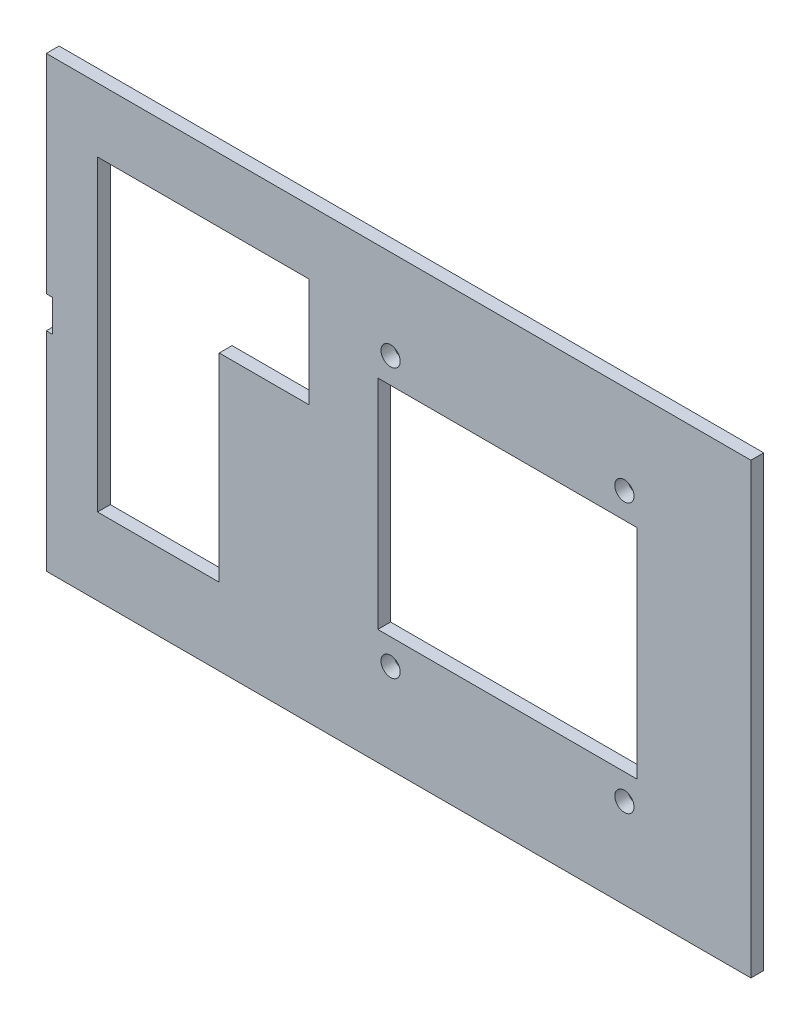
from build123d import *

# Parameters (mm, degrees)
SKETCH1_W               = 110
SKETCH1_H               = 70
BOSS_EXTRUDE1_DEPTH     = 2
CUT_EXTRUDE1_DEPTH      = 15
CUT_EXTRUDE1_DEPTH_BACK = 15
SKETCH2_W               = 2
SKETCH2_H               = 5
CUT_EXTRUDE2_DEPTH      = 10
CUT_EXTRUDE2_DEPTH_BACK = 10
SKETCH3_W               = 40.5
SKETCH3_H               = 34
CUT_EXTRUDE4_DEPTH      = 10
CUT_EXTRUDE4_DEPTH_BACK = 10
SKETCH5_R               = 1.5
CUT_EXTRUDE5_DEPTH      = 10
CUT_EXTRUDE5_DEPTH_BACK = 10
SKETCH6_W               = 19
SKETCH6_H               = 31
SKETCH6_W_2             = 33
SKETCH6_H_2             = 17


with BuildPart() as part:
    # Sketch1 → Boss-Extrude1 (new body)
    with BuildSketch(Plane.XY):
        Rectangle(SKETCH1_W, SKETCH1_H)
    extrude(amount=BOSS_EXTRUDE1_DEPTH)

    # Sketch2 → Cut-Extrude1 (cut, two sides: drawn at the far end of the back side and taken through both)
    with BuildSketch(Plane.XY.offset(2).offset(-CUT_EXTRUDE1_DEPTH_BACK)):
        with Locations((-55, 0)):
            Rectangle(SKETCH2_W, SKETCH2_H)
    extrude(amount=CUT_EXTRUDE1_DEPTH + CUT_EXTRUDE1_DEPTH_BACK, mode=Mode.SUBTRACT)

    # Sketch3 → Cut-Extrude2 (cut, two sides: drawn at the far end of the back side and taken through both)
    with BuildSketch(Plane.XY.offset(2).offset(-CUT_EXTRUDE2_DEPTH_BACK)):
        with Locations((17, 0)):
            Rectangle(SKETCH3_W, SKETCH3_H)
    extrude(amount=CUT_EXTRUDE2_DEPTH + CUT_EXTRUDE2_DEPTH_BACK, mode=Mode.SUBTRACT)

    # Sketch5 → Cut-Extrude4 (cut, two sides: drawn at the far end of the back side and taken through both)
    with BuildSketch(Plane(origin=(0, 0, 0), x_dir=(-1, 0, 0), z_dir=(0, 0, -1)).offset(-CUT_EXTRUDE4_DEPTH_BACK)):
        with Locations(Location((-35.25, 21, 0), (0, 0, 180))):
            Circle(SKETCH5_R)
        with Locations(Location((1.25, 21, 0), (0, 0, 180))):
            Circle(SKETCH5_R)
        with Locations(Location((-35.25, -21, 0), (0, 0, 180))):
            Circle(SKETCH5_R)
        with Locations(Location((1.25, -21, 0), (0, 0, 180))):
            Circle(SKETCH5_R)
    extrude(amount=CUT_EXTRUDE4_DEPTH + CUT_EXTRUDE4_DEPTH_BACK, mode=Mode.SUBTRACT)

    # Sketch6 → Cut-Extrude5 (cut, two sides: drawn at the far end of the back side and taken through both)
    with BuildSketch(Plane(origin=(0, 0, 0), x_dir=(-1, 0, 0), z_dir=(0, 0, -1)).offset(-CUT_EXTRUDE5_DEPTH_BACK)):
        with Locations((37.5, -7.5)):
            Rectangle(SKETCH6_W, SKETCH6_H)
        with Locations((30.5, 16.5)):
            Rectangle(SKETCH6_W_2, SKETCH6_H_2)
    extrude(amount=CUT_EXTRUDE5_DEPTH + CUT_EXTRUDE5_DEPTH_BACK, mode=Mode.SUBTRACT)


solid = part.part
